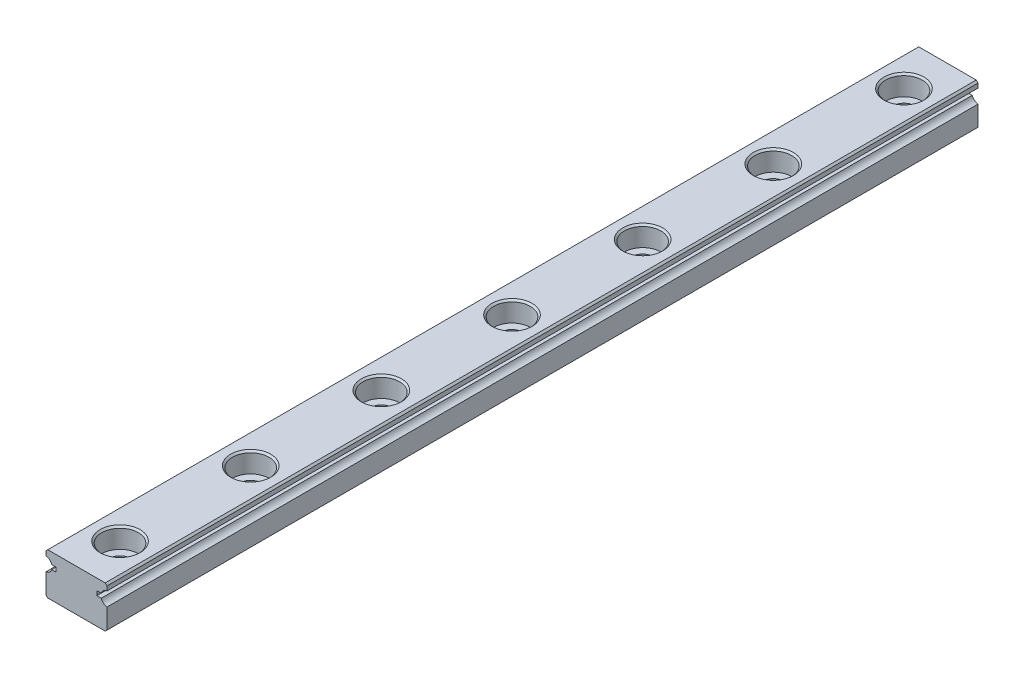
from build123d import *

# Parameters (mm, degrees)
EXTRUDE1_DEPTH             = 150
EXTRUDE2_REACH             = 152.118
SKETCH2_R                  = 1.2
SKETCH_R                   = 2.1
SKETCH_R_2                 = 1.2
EXTRUDE4_DEPTH             = 2.3
CHAMFER1_SIZE              = 0.2
LPATTERN1_COUNT            = 10
LPATTERN1_PITCH            = 15
CHAMFER1_OF_LPATTERN1_SIZE = 0.2
SKETCH3_W                  = 9.7061266
SKETCH3_H                  = 7.240457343
CUT_EXTRUDE2_DEPTH         = 30
SKETCH4_W                  = 8.375440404
SKETCH4_H                  = 5.803826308
CUT_EXTRUDE3_DEPTH         = 20


with BuildPart() as part:
    # Sketch1 → Extrude1 (new body)
    with BuildSketch(Plane.XY):
        with BuildLine():
            Line((-3.3, -2.4), (3.3, -2.4))
            Line((3.3, -2.4), (3.5, -2.2))
            Line((3.5, -2.2), (3.5, 0.106274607))
            ThreePointArc((3.5, 0.106274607), (3.091294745, 0.282570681), (2.840065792, 0.65))
            Line((2.840065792, 0.65), (2.340065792, 0.65))
            Line((2.340065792, 0.65), (2.340065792, 1.15))
            Line((2.340065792, 1.15), (2.840065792, 1.15))
            ThreePointArc((2.840065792, 1.15), (3.091294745, 1.517429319), (3.5, 1.693725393))
            Line((3.5, 1.693725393), (3.5, 2.2))
            Line((3.5, 2.2), (3.3, 2.4))
            Line((3.3, 2.4), (-3.3, 2.4))
            Line((-3.3, 2.4), (-3.5, 2.2))
            Line((-3.5, 2.2), (-3.5, 1.693725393))
            ThreePointArc((-3.5, 1.693725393), (-3.091294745, 1.517429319), (-2.840065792, 1.15))
            Line((-2.840065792, 1.15), (-2.340065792, 1.15))
            Line((-2.340065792, 1.15), (-2.340065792, 0.65))
            Line((-2.340065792, 0.65), (-2.840065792, 0.65))
            ThreePointArc((-2.840065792, 0.65), (-3.091294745, 0.282570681), (-3.5, 0.106274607))
            Line((-3.5, 0.106274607), (-3.5, -2.2))
            Line((-3.5, -2.2), (-3.3, -2.4))
        make_face()
    extrude(amount=EXTRUDE1_DEPTH)

    # Sketch2 → Extrude2 (cut, up to next)
    with BuildSketch(Plane(origin=(0, 2.4, 0), x_dir=(1, 0, 0), z_dir=(0, 1, 0)), mode=Mode.PRIVATE) as extrude2_sk1:
        with Locations(Location((0, -5, 0), (0, 0, 270))):
            Circle(SKETCH2_R)
    extrude2_tool1 = extrude(extrude2_sk1.sketch, amount=-EXTRUDE2_REACH, mode=Mode.PRIVATE) & part.part
    extrude2 = extrude2_tool1.solids().sort_by_distance((0, 2.4, 5))[0]
    add(extrude2, mode=Mode.SUBTRACT)

    # Sketch → Extrude4 (cut)
    with BuildSketch(Plane(origin=(0, 2.4, 0), x_dir=(1, 0, 0), z_dir=(0, 1, 0))):
        with Locations(Location((0, -5, 0), (0, 0, 270))):
            Circle(SKETCH_R)
        with Locations(Location((0, -5, 0), (0, 0, 270))):
            Circle(SKETCH_R_2, mode=Mode.SUBTRACT)
    extrude4 = extrude(amount=-EXTRUDE4_DEPTH, mode=Mode.SUBTRACT)

    # Chamfer1
    chamfer1_edges = [part.edges().sort_by_distance(p)[0] for p in [
        (0, -2.4, 3.8),
        (0, 2.4, 2.9),
    ]]
    chamfer(chamfer1_edges, length=CHAMFER1_SIZE)

    # LPattern1: Extrude2, Extrude4 ×10
    with Locations(*[(0, 0, i * LPATTERN1_PITCH) for i in range(1, LPATTERN1_COUNT)]):
        add(extrude2, mode=Mode.SUBTRACT)
        add(extrude4, mode=Mode.SUBTRACT)

    # Chamfer1 of LPattern1
    chamfer1_of_lpattern1_edges = [part.edges().sort_by_distance(p)[0] for p in [
        (0, -2.4, 18.8),
        (0, 2.4, 17.9),
        (0, -2.4, 33.8),
        (0, 2.4, 32.9),
        (0, -2.4, 48.8),
        (0, 2.4, 47.9),
        (0, -2.4, 63.8),
        (0, 2.4, 62.9),
        (0, -2.4, 78.8),
        (0, 2.4, 77.9),
        (0, -2.4, 93.8),
        (0, 2.4, 92.9),
        (0, -2.4, 108.8),
        (0, 2.4, 107.9),
        (0, -2.4, 123.8),
        (0, 2.4, 122.9),
        (0, -2.4, 138.8),
        (0, 2.4, 137.9),
    ]]
    chamfer(chamfer1_of_lpattern1_edges, length=CHAMFER1_OF_LPATTERN1_SIZE)

    # Sketch3 → Cut-Extrude2 (cut)
    with BuildSketch(Plane(origin=(0, 0, 0), x_dir=(-1, 0, 0), z_dir=(0, 0, -1))):
        with Locations((-0.166334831, 0.38159167)):
            Rectangle(SKETCH3_W, SKETCH3_H)
    extrude(amount=-CUT_EXTRUDE2_DEPTH, mode=Mode.SUBTRACT)

    # Sketch4 → Cut-Extrude3 (cut)
    with BuildSketch(Plane.XY.offset(150)):
        with Locations((0.110099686, -0.019660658)):
            Rectangle(SKETCH4_W, SKETCH4_H)
    extrude(amount=-CUT_EXTRUDE3_DEPTH, mode=Mode.SUBTRACT)


solid = part.part
